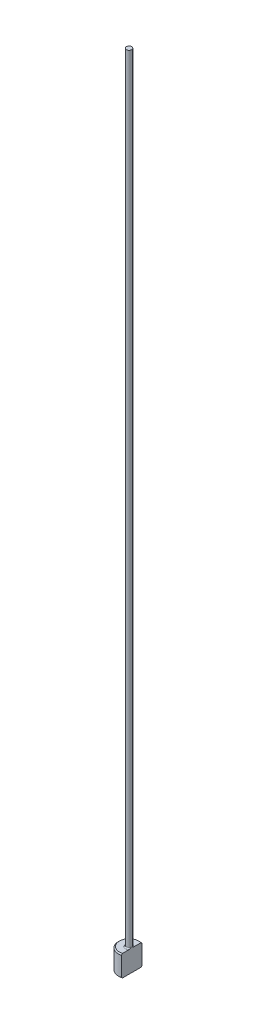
from build123d import *
from build123d.topology import SkipClean

# Parameters (mm, degrees)
CHAMFER1_SIZE    = 0.2
FILLET1_R        = 0.2
KEYED_HEAD_DEPTH = 151.026664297


with BuildPart() as part:
    # Sketch1 → Revolve1 (revolve)
    with BuildSketch(Plane.XY, mode=Mode.PRIVATE) as revolve1_sk:
        Polygon((0, 0), (-2, 0), (-2, 4), (-0.5, 4), (-0.5, 150), (0, 150), align=None)
    revolve(revolve1_sk.sketch.rotate(Axis((0, 259.958771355, 0), (0, -1, 0)), 270), axis=Axis((0, 259.958771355, 0), (0, -1, 0)))

    # Chamfer1
    chamfer1_edges = [part.edges().sort_by_distance(p)[0] for p in [
        (0, 4, -2),
        (0, 0, -2),
    ]]
    chamfer(chamfer1_edges, length=CHAMFER1_SIZE)

    # Fillet1
    fillet1_edges = [part.edges().sort_by_distance(p)[0] for p in [
        (0, 4, -0.5),
    ]]
    fillet(fillet1_edges, radius=FILLET1_R)

    # Sketch2 → KEYED HEAD (cut, through all)
    with SkipClean():  # the faces are left unmerged after this step: merging them gives an invalid solid
        with BuildSketch(Plane(origin=(0, 0, 0), x_dir=(1, 0, 0), z_dir=(0, 1, 0))):
            with BuildLine():
                Line((0.5, -1.936491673), (0.5, 1.936491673))
                ThreePointArc((0.5, 1.936491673), (2, 0), (0.5, -1.936491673))
            make_face()
        extrude(amount=KEYED_HEAD_DEPTH, mode=Mode.SUBTRACT)


solid = part.part
